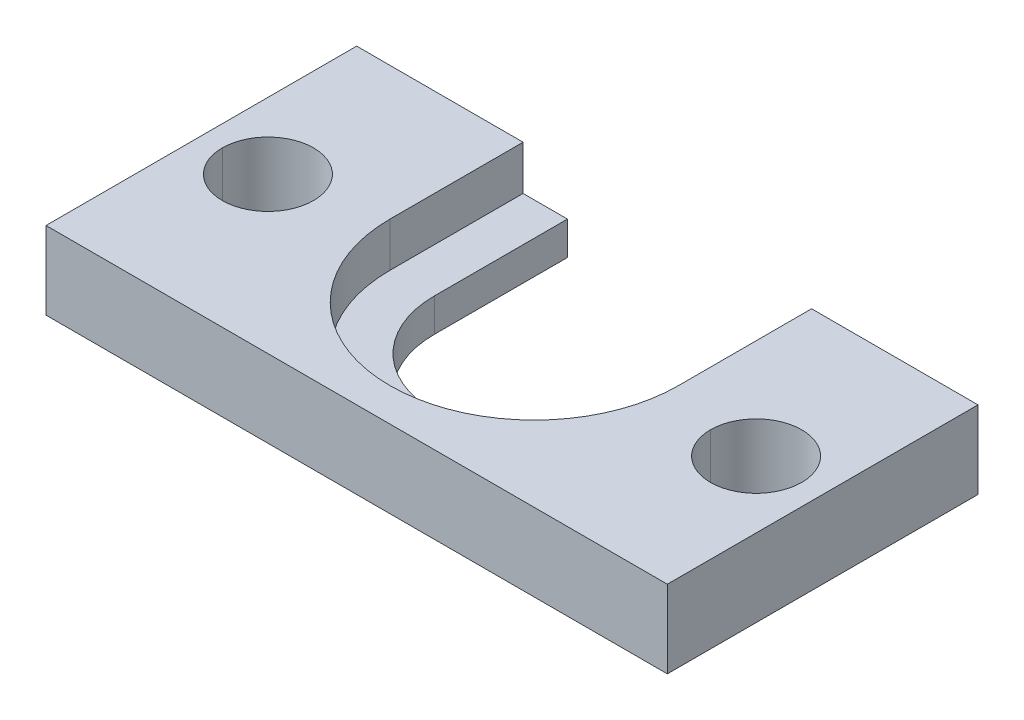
ISO-10303-21;
HEADER;
FILE_DESCRIPTION(('STEP AP214'),'2;1');
FILE_NAME('part.step','',(''),(''),'','','');
FILE_SCHEMA(('AUTOMOTIVE_DESIGN { 1 0 10303 214 1 1 1 1 }'));
ENDSEC;
DATA;
#1=APPLICATION_CONTEXT('core data for automotive mechanical design processes');
#2=APPLICATION_PROTOCOL_DEFINITION('international standard','automotive_design',2000,#1);
#3=PRODUCT_CONTEXT('',#1,'mechanical');
#4=PRODUCT('Part','Part','',(#3));
#5=PRODUCT_RELATED_PRODUCT_CATEGORY('part','',(#4));
#6=PRODUCT_DEFINITION_FORMATION('','',#4);
#7=PRODUCT_DEFINITION_CONTEXT('part definition',#1,'design');
#8=PRODUCT_DEFINITION('design','',#6,#7);
#9=PRODUCT_DEFINITION_SHAPE('','',#8);
#10=(LENGTH_UNIT() NAMED_UNIT(*) SI_UNIT(.MILLI.,.METRE.));
#11=(NAMED_UNIT(*) PLANE_ANGLE_UNIT() SI_UNIT($,.RADIAN.));
#12=(NAMED_UNIT(*) SI_UNIT($,.STERADIAN.) SOLID_ANGLE_UNIT());
#13=UNCERTAINTY_MEASURE_WITH_UNIT(LENGTH_MEASURE(1.E-05),#10,'distance_accuracy_value','');
#14=(GEOMETRIC_REPRESENTATION_CONTEXT(3) GLOBAL_UNCERTAINTY_ASSIGNED_CONTEXT((#13)) GLOBAL_UNIT_ASSIGNED_CONTEXT((#10,
#11,#12)) REPRESENTATION_CONTEXT('',''));
#15=CARTESIAN_POINT('',(0.,0.,0.));
#16=DIRECTION('',(0.,0.,1.));
#17=DIRECTION('',(1.,0.,0.));
#18=AXIS2_PLACEMENT_3D('',#15,#16,#17);
#19=CARTESIAN_POINT('',(0.,1.190625,-1.58750000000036));
#20=DIRECTION('',(0.,-1.,0.));
#21=DIRECTION('',(1.,0.,0.));
#22=AXIS2_PLACEMENT_3D('',#19,#20,#21);
#23=CYLINDRICAL_SURFACE('',#22,10.31875);
#24=CARTESIAN_POINT('',(0.,2.778125,-1.58750000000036));
#25=DIRECTION('',(0.,-1.,0.));
#26=DIRECTION('',(1.,0.,0.));
#27=AXIS2_PLACEMENT_3D('',#24,#25,#26);
#28=CIRCLE('',#27,10.31875);
#29=CARTESIAN_POINT('',(-10.31875,2.778125,-1.58750000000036));
#30=VERTEX_POINT('',#29);
#31=CARTESIAN_POINT('',(10.31875,2.778125,-1.58750000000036));
#32=VERTEX_POINT('',#31);
#33=EDGE_CURVE('E150',#30,#32,#28,.F.);
#34=ORIENTED_EDGE('',*,*,#33,.T.);
#35=DIRECTION('',(0.,1.,0.));
#36=VECTOR('',#35,1.);
#37=CARTESIAN_POINT('',(10.31875,-0.396875,-1.58750000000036));
#38=LINE('',#37,#36);
#39=CARTESIAN_POINT('',(10.31875,-0.396875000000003,-1.58750000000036));
#40=VERTEX_POINT('',#39);
#41=EDGE_CURVE('E127',#32,#40,#38,.F.);
#42=ORIENTED_EDGE('',*,*,#41,.T.);
#43=CARTESIAN_POINT('',(0.,-0.396875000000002,-1.58750000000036));
#44=DIRECTION('',(0.,-1.,0.));
#45=DIRECTION('',(1.,0.,0.));
#46=AXIS2_PLACEMENT_3D('',#43,#44,#45);
#47=CIRCLE('',#46,10.31875);
#48=CARTESIAN_POINT('',(-10.31875,-0.396874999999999,-1.58750000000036));
#49=VERTEX_POINT('',#48);
#50=EDGE_CURVE('E19',#40,#49,#47,.T.);
#51=ORIENTED_EDGE('',*,*,#50,.T.);
#52=DIRECTION('',(0.,-1.,0.));
#53=VECTOR('',#52,1.);
#54=CARTESIAN_POINT('',(-10.31875,2.778125,-1.58750000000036));
#55=LINE('',#54,#53);
#56=EDGE_CURVE('E131',#49,#30,#55,.F.);
#57=ORIENTED_EDGE('',*,*,#56,.T.);
#58=EDGE_LOOP('',(#34,#42,#51,#57));
#59=FACE_BOUND('',#58,.T.);
#60=ADVANCED_FACE('F16',(#59),#23,.F.);
#61=CARTESIAN_POINT('',(-10.31875,2.778125,-1.58750000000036));
#62=DIRECTION('',(-1.,0.,0.));
#63=DIRECTION('',(0.,-1.,0.));
#64=AXIS2_PLACEMENT_3D('',#61,#62,#63);
#65=PLANE('',#64);
#66=DIRECTION('',(0.,0.,1.));
#67=VECTOR('',#66,1.);
#68=CARTESIAN_POINT('',(-10.31875,2.778125,0.));
#69=LINE('',#68,#67);
#70=CARTESIAN_POINT('',(-10.31875,2.778125,-11.1125000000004));
#71=VERTEX_POINT('',#70);
#72=EDGE_CURVE('E142',#71,#30,#69,.T.);
#73=ORIENTED_EDGE('',*,*,#72,.T.);
#74=ORIENTED_EDGE('',*,*,#56,.F.);
#75=DIRECTION('',(0.,0.,1.));
#76=VECTOR('',#75,1.);
#77=CARTESIAN_POINT('',(-10.31875,-0.396874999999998,-1.58750000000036));
#78=LINE('',#77,#76);
#79=CARTESIAN_POINT('',(-10.31875,-0.396875,-11.1125000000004));
#80=VERTEX_POINT('',#79);
#81=EDGE_CURVE('E136',#49,#80,#78,.F.);
#82=ORIENTED_EDGE('',*,*,#81,.T.);
#83=DIRECTION('',(0.,-1.,0.));
#84=VECTOR('',#83,1.);
#85=CARTESIAN_POINT('',(-10.31875,0.,-11.1125000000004));
#86=LINE('',#85,#84);
#87=EDGE_CURVE('E181',#80,#71,#86,.F.);
#88=ORIENTED_EDGE('',*,*,#87,.T.);
#89=EDGE_LOOP('',(#73,#74,#82,#88));
#90=FACE_BOUND('',#89,.T.);
#91=ADVANCED_FACE('F139',(#90),#65,.F.);
#92=CARTESIAN_POINT('',(10.31875,-0.396875,-1.58750000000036));
#93=DIRECTION('',(1.,0.,0.));
#94=DIRECTION('',(0.,1.,0.));
#95=AXIS2_PLACEMENT_3D('',#92,#93,#94);
#96=PLANE('',#95);
#97=DIRECTION('',(0.,0.,1.));
#98=VECTOR('',#97,1.);
#99=CARTESIAN_POINT('',(10.31875,-0.396875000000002,-1.58750000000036));
#100=LINE('',#99,#98);
#101=CARTESIAN_POINT('',(10.31875,-0.396875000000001,-11.1125000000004));
#102=VERTEX_POINT('',#101);
#103=EDGE_CURVE('E137',#102,#40,#100,.T.);
#104=ORIENTED_EDGE('',*,*,#103,.T.);
#105=ORIENTED_EDGE('',*,*,#41,.F.);
#106=DIRECTION('',(0.,0.,1.));
#107=VECTOR('',#106,1.);
#108=CARTESIAN_POINT('',(10.31875,2.77812499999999,0.));
#109=LINE('',#108,#107);
#110=CARTESIAN_POINT('',(10.31875,2.77812499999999,-11.1125000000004));
#111=VERTEX_POINT('',#110);
#112=EDGE_CURVE('E237',#32,#111,#109,.F.);
#113=ORIENTED_EDGE('',*,*,#112,.T.);
#114=DIRECTION('',(0.,1.,0.));
#115=VECTOR('',#114,1.);
#116=CARTESIAN_POINT('',(10.31875,2.778125,-11.1125000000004));
#117=LINE('',#116,#115);
#118=EDGE_CURVE('E200',#102,#111,#117,.T.);
#119=ORIENTED_EDGE('',*,*,#118,.F.);
#120=EDGE_LOOP('',(#104,#105,#113,#119));
#121=FACE_BOUND('',#120,.T.);
#122=ADVANCED_FACE('F291',(#121),#96,.F.);
#123=CARTESIAN_POINT('',(0.,-0.396875,-1.58750000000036));
#124=DIRECTION('',(0.,-1.,0.));
#125=DIRECTION('',(1.,0.,0.));
#126=AXIS2_PLACEMENT_3D('',#123,#124,#125);
#127=PLANE('',#126);
#128=ORIENTED_EDGE('',*,*,#81,.F.);
#129=ORIENTED_EDGE('',*,*,#50,.F.);
#130=ORIENTED_EDGE('',*,*,#103,.F.);
#131=DIRECTION('',(-1.,0.,0.));
#132=VECTOR('',#131,1.);
#133=CARTESIAN_POINT('',(0.,-0.396875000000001,-11.1125000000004));
#134=LINE('',#133,#132);
#135=CARTESIAN_POINT('',(7.14375,-0.396875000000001,-11.1125000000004));
#136=VERTEX_POINT('',#135);
#137=EDGE_CURVE('E167',#136,#102,#134,.F.);
#138=ORIENTED_EDGE('',*,*,#137,.F.);
#139=DIRECTION('',(0.,0.,1.));
#140=VECTOR('',#139,1.);
#141=CARTESIAN_POINT('',(7.14375,-0.396875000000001,-1.58750000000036));
#142=LINE('',#141,#140);
#143=CARTESIAN_POINT('',(7.14375,-0.396875,-1.58750000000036));
#144=VERTEX_POINT('',#143);
#145=EDGE_CURVE('E161',#136,#144,#142,.T.);
#146=ORIENTED_EDGE('',*,*,#145,.T.);
#147=CARTESIAN_POINT('',(0.,-0.396874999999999,-1.58750000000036));
#148=DIRECTION('',(0.,-1.,0.));
#149=DIRECTION('',(1.,0.,0.));
#150=AXIS2_PLACEMENT_3D('',#147,#148,#149);
#151=CIRCLE('',#150,7.14375);
#152=CARTESIAN_POINT('',(-7.14375,-0.396874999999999,-1.58750000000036));
#153=VERTEX_POINT('',#152);
#154=EDGE_CURVE('E225',#144,#153,#151,.T.);
#155=ORIENTED_EDGE('',*,*,#154,.T.);
#156=DIRECTION('',(0.,0.,1.));
#157=VECTOR('',#156,1.);
#158=CARTESIAN_POINT('',(-7.14375,-0.396875,-1.58750000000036));
#159=LINE('',#158,#157);
#160=CARTESIAN_POINT('',(-7.14375,-0.396875,-11.1125000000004));
#161=VERTEX_POINT('',#160);
#162=EDGE_CURVE('E174',#153,#161,#159,.F.);
#163=ORIENTED_EDGE('',*,*,#162,.T.);
#164=DIRECTION('',(1.,0.,0.));
#165=VECTOR('',#164,1.);
#166=CARTESIAN_POINT('',(-20.6375,-0.396875,-11.1125000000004));
#167=LINE('',#166,#165);
#168=EDGE_CURVE('E147',#161,#80,#167,.F.);
#169=ORIENTED_EDGE('',*,*,#168,.T.);
#170=EDGE_LOOP('',(#128,#129,#130,#138,#146,#155,#163,#169));
#171=FACE_BOUND('',#170,.T.);
#172=ADVANCED_FACE('F145',(#171),#127,.F.);
#173=CARTESIAN_POINT('',(-20.6375,2.778125,0.));
#174=DIRECTION('',(0.,-1.,0.));
#175=DIRECTION('',(1.,0.,0.));
#176=AXIS2_PLACEMENT_3D('',#173,#174,#175);
#177=PLANE('',#176);
#178=DIRECTION('',(0.,0.,1.));
#179=VECTOR('',#178,1.);
#180=CARTESIAN_POINT('',(-22.225,2.778125,0.));
#181=LINE('',#180,#179);
#182=CARTESIAN_POINT('',(-22.225,2.778125,-11.1125000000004));
#183=VERTEX_POINT('',#182);
#184=CARTESIAN_POINT('',(-22.225,2.778125,11.1125000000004));
#185=VERTEX_POINT('',#184);
#186=EDGE_CURVE('E185',#183,#185,#181,.T.);
#187=ORIENTED_EDGE('',*,*,#186,.T.);
#188=DIRECTION('',(-1.,0.,0.));
#189=VECTOR('',#188,1.);
#190=CARTESIAN_POINT('',(-20.6375,2.778125,11.1125000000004));
#191=LINE('',#190,#189);
#192=CARTESIAN_POINT('',(22.225,2.778125,11.1125000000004));
#193=VERTEX_POINT('',#192);
#194=EDGE_CURVE('E187',#185,#193,#191,.F.);
#195=ORIENTED_EDGE('',*,*,#194,.T.);
#196=DIRECTION('',(0.,0.,1.));
#197=VECTOR('',#196,1.);
#198=CARTESIAN_POINT('',(22.225,2.778125,0.));
#199=LINE('',#198,#197);
#200=CARTESIAN_POINT('',(22.225,2.778125,-11.1125000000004));
#201=VERTEX_POINT('',#200);
#202=EDGE_CURVE('E252',#193,#201,#199,.F.);
#203=ORIENTED_EDGE('',*,*,#202,.T.);
#204=DIRECTION('',(-1.,0.,0.));
#205=VECTOR('',#204,1.);
#206=CARTESIAN_POINT('',(0.,2.778125,-11.1125000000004));
#207=LINE('',#206,#205);
#208=EDGE_CURVE('E198',#111,#201,#207,.F.);
#209=ORIENTED_EDGE('',*,*,#208,.F.);
#210=ORIENTED_EDGE('',*,*,#112,.F.);
#211=ORIENTED_EDGE('',*,*,#33,.F.);
#212=ORIENTED_EDGE('',*,*,#72,.F.);
#213=DIRECTION('',(1.,0.,0.));
#214=VECTOR('',#213,1.);
#215=CARTESIAN_POINT('',(-20.6375,2.778125,-11.1125000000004));
#216=LINE('',#215,#214);
#217=EDGE_CURVE('E190',#71,#183,#216,.F.);
#218=ORIENTED_EDGE('',*,*,#217,.T.);
#219=EDGE_LOOP('',(#187,#195,#203,#209,#210,#211,#212,#218));
#220=FACE_BOUND('',#219,.T.);
#221=CARTESIAN_POINT('',(17.4625,2.778125,0.));
#222=DIRECTION('',(0.,-1.,0.));
#223=DIRECTION('',(1.,0.,0.));
#224=AXIS2_PLACEMENT_3D('',#221,#222,#223);
#225=CIRCLE('',#224,3.2639);
#226=CARTESIAN_POINT('',(14.1986,2.778125,0.));
#227=VERTEX_POINT('',#226);
#228=CARTESIAN_POINT('',(20.7264,2.778125,0.));
#229=VERTEX_POINT('',#228);
#230=EDGE_CURVE('E227',#227,#229,#225,.T.);
#231=ORIENTED_EDGE('',*,*,#230,.T.);
#232=CARTESIAN_POINT('',(17.4625,2.778125,0.));
#233=DIRECTION('',(0.,-1.,0.));
#234=DIRECTION('',(1.,0.,0.));
#235=AXIS2_PLACEMENT_3D('',#232,#233,#234);
#236=CIRCLE('',#235,3.2639);
#237=EDGE_CURVE('E230',#229,#227,#236,.T.);
#238=ORIENTED_EDGE('',*,*,#237,.T.);
#239=EDGE_LOOP('',(#231,#238));
#240=FACE_BOUND('',#239,.T.);
#241=CARTESIAN_POINT('',(-17.4625,2.778125,0.));
#242=DIRECTION('',(0.,1.,0.));
#243=DIRECTION('',(-1.,0.,0.));
#244=AXIS2_PLACEMENT_3D('',#241,#242,#243);
#245=CIRCLE('',#244,3.2639);
#246=CARTESIAN_POINT('',(-14.1986,2.778125,0.));
#247=VERTEX_POINT('',#246);
#248=CARTESIAN_POINT('',(-20.7264,2.778125,0.));
#249=VERTEX_POINT('',#248);
#250=EDGE_CURVE('E233',#247,#249,#245,.F.);
#251=ORIENTED_EDGE('',*,*,#250,.T.);
#252=CARTESIAN_POINT('',(-17.4625,2.778125,0.));
#253=DIRECTION('',(0.,1.,0.));
#254=DIRECTION('',(-1.,0.,0.));
#255=AXIS2_PLACEMENT_3D('',#252,#253,#254);
#256=CIRCLE('',#255,3.2639);
#257=EDGE_CURVE('E236',#249,#247,#256,.F.);
#258=ORIENTED_EDGE('',*,*,#257,.T.);
#259=EDGE_LOOP('',(#251,#258));
#260=FACE_BOUND('',#259,.T.);
#261=ADVANCED_FACE('F282',(#220,#240,#260),#177,.F.);
#262=CARTESIAN_POINT('',(-17.4625,3.571875,0.));
#263=DIRECTION('',(0.,1.,0.));
#264=DIRECTION('',(-1.,0.,0.));
#265=AXIS2_PLACEMENT_3D('',#262,#263,#264);
#266=CYLINDRICAL_SURFACE('',#265,3.2639);
#267=ORIENTED_EDGE('',*,*,#257,.F.);
#268=DIRECTION('',(0.,1.,0.));
#269=VECTOR('',#268,1.);
#270=CARTESIAN_POINT('',(-20.7264,3.571875,0.));
#271=LINE('',#270,#269);
#272=CARTESIAN_POINT('',(-20.7264,-2.778125,0.));
#273=VERTEX_POINT('',#272);
#274=EDGE_CURVE('E235',#249,#273,#271,.F.);
#275=ORIENTED_EDGE('',*,*,#274,.T.);
#276=CARTESIAN_POINT('',(-17.4625,-2.778125,0.));
#277=DIRECTION('',(0.,1.,0.));
#278=DIRECTION('',(-1.,0.,0.));
#279=AXIS2_PLACEMENT_3D('',#276,#277,#278);
#280=CIRCLE('',#279,3.2639);
#281=CARTESIAN_POINT('',(-14.1986,-2.778125,0.));
#282=VERTEX_POINT('',#281);
#283=EDGE_CURVE('E222',#282,#273,#280,.T.);
#284=ORIENTED_EDGE('',*,*,#283,.F.);
#285=DIRECTION('',(0.,1.,0.));
#286=VECTOR('',#285,1.);
#287=CARTESIAN_POINT('',(-14.1986,3.571875,0.));
#288=LINE('',#287,#286);
#289=EDGE_CURVE('E232',#282,#247,#288,.T.);
#290=ORIENTED_EDGE('',*,*,#289,.T.);
#291=EDGE_LOOP('',(#267,#275,#284,#290));
#292=FACE_BOUND('',#291,.T.);
#293=ADVANCED_FACE('F278',(#292),#266,.F.);
#294=CARTESIAN_POINT('',(-17.4625,3.571875,0.));
#295=DIRECTION('',(0.,1.,0.));
#296=DIRECTION('',(-1.,0.,0.));
#297=AXIS2_PLACEMENT_3D('',#294,#295,#296);
#298=CYLINDRICAL_SURFACE('',#297,3.2639);
#299=CARTESIAN_POINT('',(-17.4625,-2.778125,0.));
#300=DIRECTION('',(0.,1.,0.));
#301=DIRECTION('',(-1.,0.,0.));
#302=AXIS2_PLACEMENT_3D('',#299,#300,#301);
#303=CIRCLE('',#302,3.2639);
#304=EDGE_CURVE('E219',#273,#282,#303,.T.);
#305=ORIENTED_EDGE('',*,*,#304,.F.);
#306=ORIENTED_EDGE('',*,*,#274,.F.);
#307=ORIENTED_EDGE('',*,*,#250,.F.);
#308=ORIENTED_EDGE('',*,*,#289,.F.);
#309=EDGE_LOOP('',(#305,#306,#307,#308));
#310=FACE_BOUND('',#309,.T.);
#311=ADVANCED_FACE('F280',(#310),#298,.F.);
#312=CARTESIAN_POINT('',(17.4625,3.571875,0.));
#313=DIRECTION('',(0.,-1.,0.));
#314=DIRECTION('',(1.,0.,0.));
#315=AXIS2_PLACEMENT_3D('',#312,#313,#314);
#316=CYLINDRICAL_SURFACE('',#315,3.2639);
#317=ORIENTED_EDGE('',*,*,#237,.F.);
#318=DIRECTION('',(0.,-1.,0.));
#319=VECTOR('',#318,1.);
#320=CARTESIAN_POINT('',(20.7264,3.571875,0.));
#321=LINE('',#320,#319);
#322=CARTESIAN_POINT('',(20.7264,-2.778125,0.));
#323=VERTEX_POINT('',#322);
#324=EDGE_CURVE('E229',#229,#323,#321,.T.);
#325=ORIENTED_EDGE('',*,*,#324,.T.);
#326=CARTESIAN_POINT('',(17.4625,-2.778125,0.));
#327=DIRECTION('',(0.,-1.,0.));
#328=DIRECTION('',(1.,0.,0.));
#329=AXIS2_PLACEMENT_3D('',#326,#327,#328);
#330=CIRCLE('',#329,3.2639);
#331=CARTESIAN_POINT('',(14.1986,-2.778125,0.));
#332=VERTEX_POINT('',#331);
#333=EDGE_CURVE('E216',#332,#323,#330,.F.);
#334=ORIENTED_EDGE('',*,*,#333,.F.);
#335=DIRECTION('',(0.,-1.,0.));
#336=VECTOR('',#335,1.);
#337=CARTESIAN_POINT('',(14.1986,3.571875,0.));
#338=LINE('',#337,#336);
#339=EDGE_CURVE('E250',#332,#227,#338,.F.);
#340=ORIENTED_EDGE('',*,*,#339,.T.);
#341=EDGE_LOOP('',(#317,#325,#334,#340));
#342=FACE_BOUND('',#341,.T.);
#343=ADVANCED_FACE('F336',(#342),#316,.F.);
#344=CARTESIAN_POINT('',(17.4625,3.571875,0.));
#345=DIRECTION('',(0.,-1.,0.));
#346=DIRECTION('',(1.,0.,0.));
#347=AXIS2_PLACEMENT_3D('',#344,#345,#346);
#348=CYLINDRICAL_SURFACE('',#347,3.2639);
#349=CARTESIAN_POINT('',(17.4625,-2.778125,0.));
#350=DIRECTION('',(0.,-1.,0.));
#351=DIRECTION('',(1.,0.,0.));
#352=AXIS2_PLACEMENT_3D('',#349,#350,#351);
#353=CIRCLE('',#352,3.2639);
#354=EDGE_CURVE('E212',#323,#332,#353,.F.);
#355=ORIENTED_EDGE('',*,*,#354,.F.);
#356=ORIENTED_EDGE('',*,*,#324,.F.);
#357=ORIENTED_EDGE('',*,*,#230,.F.);
#358=ORIENTED_EDGE('',*,*,#339,.F.);
#359=EDGE_LOOP('',(#355,#356,#357,#358));
#360=FACE_BOUND('',#359,.T.);
#361=ADVANCED_FACE('F333',(#360),#348,.F.);
#362=CARTESIAN_POINT('',(-20.6375,0.,11.1125000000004));
#363=DIRECTION('',(0.,0.,-1.));
#364=DIRECTION('',(-1.,0.,0.));
#365=AXIS2_PLACEMENT_3D('',#362,#363,#364);
#366=PLANE('',#365);
#367=DIRECTION('',(1.,0.,0.));
#368=VECTOR('',#367,1.);
#369=CARTESIAN_POINT('',(-20.6375,-2.778125,11.1125000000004));
#370=LINE('',#369,#368);
#371=CARTESIAN_POINT('',(22.225,-2.77812500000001,11.1125000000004));
#372=VERTEX_POINT('',#371);
#373=CARTESIAN_POINT('',(-22.225,-2.778125,11.1125000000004));
#374=VERTEX_POINT('',#373);
#375=EDGE_CURVE('E215',#372,#374,#370,.F.);
#376=ORIENTED_EDGE('',*,*,#375,.F.);
#377=DIRECTION('',(0.,-1.,0.));
#378=VECTOR('',#377,1.);
#379=CARTESIAN_POINT('',(22.225,0.,11.1125000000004));
#380=LINE('',#379,#378);
#381=EDGE_CURVE('E170',#372,#193,#380,.F.);
#382=ORIENTED_EDGE('',*,*,#381,.T.);
#383=ORIENTED_EDGE('',*,*,#194,.F.);
#384=DIRECTION('',(0.,1.,0.));
#385=VECTOR('',#384,1.);
#386=CARTESIAN_POINT('',(-22.225,0.,11.1125000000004));
#387=LINE('',#386,#385);
#388=EDGE_CURVE('E182',#185,#374,#387,.F.);
#389=ORIENTED_EDGE('',*,*,#388,.T.);
#390=EDGE_LOOP('',(#376,#382,#383,#389));
#391=FACE_BOUND('',#390,.T.);
#392=ADVANCED_FACE('F329',(#391),#366,.F.);
#393=CARTESIAN_POINT('',(-22.225,0.,0.));
#394=DIRECTION('',(1.,0.,0.));
#395=DIRECTION('',(0.,1.,0.));
#396=AXIS2_PLACEMENT_3D('',#393,#394,#395);
#397=PLANE('',#396);
#398=DIRECTION('',(0.,0.,1.));
#399=VECTOR('',#398,1.);
#400=CARTESIAN_POINT('',(-22.225,-2.778125,0.));
#401=LINE('',#400,#399);
#402=CARTESIAN_POINT('',(-22.225,-2.778125,-11.1125000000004));
#403=VERTEX_POINT('',#402);
#404=EDGE_CURVE('E437',#374,#403,#401,.F.);
#405=ORIENTED_EDGE('',*,*,#404,.F.);
#406=ORIENTED_EDGE('',*,*,#388,.F.);
#407=ORIENTED_EDGE('',*,*,#186,.F.);
#408=DIRECTION('',(0.,-1.,0.));
#409=VECTOR('',#408,1.);
#410=CARTESIAN_POINT('',(-22.225,0.,-11.1125000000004));
#411=LINE('',#410,#409);
#412=EDGE_CURVE('E177',#183,#403,#411,.T.);
#413=ORIENTED_EDGE('',*,*,#412,.T.);
#414=EDGE_LOOP('',(#405,#406,#407,#413));
#415=FACE_BOUND('',#414,.T.);
#416=ADVANCED_FACE('F325',(#415),#397,.F.);
#417=CARTESIAN_POINT('',(-20.6375,0.,-11.1125000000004));
#418=DIRECTION('',(0.,0.,1.));
#419=DIRECTION('',(0.,-1.,0.));
#420=AXIS2_PLACEMENT_3D('',#417,#418,#419);
#421=PLANE('',#420);
#422=ORIENTED_EDGE('',*,*,#412,.F.);
#423=ORIENTED_EDGE('',*,*,#217,.F.);
#424=ORIENTED_EDGE('',*,*,#87,.F.);
#425=ORIENTED_EDGE('',*,*,#168,.F.);
#426=DIRECTION('',(0.,-1.,0.));
#427=VECTOR('',#426,1.);
#428=CARTESIAN_POINT('',(-7.14375,-0.396875,-11.1125000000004));
#429=LINE('',#428,#427);
#430=CARTESIAN_POINT('',(-7.14375,-2.778125,-11.1125000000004));
#431=VERTEX_POINT('',#430);
#432=EDGE_CURVE('E176',#161,#431,#429,.T.);
#433=ORIENTED_EDGE('',*,*,#432,.T.);
#434=DIRECTION('',(1.,0.,0.));
#435=VECTOR('',#434,1.);
#436=CARTESIAN_POINT('',(-20.6375,-2.778125,-11.1125000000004));
#437=LINE('',#436,#435);
#438=EDGE_CURVE('E434',#403,#431,#437,.T.);
#439=ORIENTED_EDGE('',*,*,#438,.F.);
#440=EDGE_LOOP('',(#422,#423,#424,#425,#433,#439));
#441=FACE_BOUND('',#440,.T.);
#442=ADVANCED_FACE('F321',(#441),#421,.F.);
#443=CARTESIAN_POINT('',(-7.14375,-0.396875,-1.58750000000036));
#444=DIRECTION('',(-1.,0.,0.));
#445=DIRECTION('',(0.,-1.,0.));
#446=AXIS2_PLACEMENT_3D('',#443,#444,#445);
#447=PLANE('',#446);
#448=ORIENTED_EDGE('',*,*,#162,.F.);
#449=DIRECTION('',(0.,-1.,0.));
#450=VECTOR('',#449,1.);
#451=CARTESIAN_POINT('',(-7.14375,-1.5875,-1.58750000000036));
#452=LINE('',#451,#450);
#453=CARTESIAN_POINT('',(-7.14375,-2.778125,-1.58750000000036));
#454=VERTEX_POINT('',#453);
#455=EDGE_CURVE('E164',#153,#454,#452,.T.);
#456=ORIENTED_EDGE('',*,*,#455,.T.);
#457=DIRECTION('',(0.,0.,1.));
#458=VECTOR('',#457,1.);
#459=CARTESIAN_POINT('',(-7.14375,-2.778125,0.));
#460=LINE('',#459,#458);
#461=EDGE_CURVE('E211',#431,#454,#460,.T.);
#462=ORIENTED_EDGE('',*,*,#461,.F.);
#463=ORIENTED_EDGE('',*,*,#432,.F.);
#464=EDGE_LOOP('',(#448,#456,#462,#463));
#465=FACE_BOUND('',#464,.T.);
#466=ADVANCED_FACE('F317',(#465),#447,.F.);
#467=CARTESIAN_POINT('',(0.,-1.5875,-1.58750000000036));
#468=DIRECTION('',(0.,-1.,0.));
#469=DIRECTION('',(1.,0.,0.));
#470=AXIS2_PLACEMENT_3D('',#467,#468,#469);
#471=CYLINDRICAL_SURFACE('',#470,7.14375);
#472=CARTESIAN_POINT('',(0.,-2.778125,-1.58750000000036));
#473=DIRECTION('',(0.,-1.,0.));
#474=DIRECTION('',(1.,0.,0.));
#475=AXIS2_PLACEMENT_3D('',#472,#473,#474);
#476=CIRCLE('',#475,7.14375);
#477=CARTESIAN_POINT('',(7.14375,-2.778125,-1.58750000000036));
#478=VERTEX_POINT('',#477);
#479=EDGE_CURVE('E207',#454,#478,#476,.F.);
#480=ORIENTED_EDGE('',*,*,#479,.F.);
#481=ORIENTED_EDGE('',*,*,#455,.F.);
#482=ORIENTED_EDGE('',*,*,#154,.F.);
#483=DIRECTION('',(0.,1.,0.));
#484=VECTOR('',#483,1.);
#485=CARTESIAN_POINT('',(7.14375,-2.778125,-1.58750000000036));
#486=LINE('',#485,#484);
#487=EDGE_CURVE('E163',#144,#478,#486,.F.);
#488=ORIENTED_EDGE('',*,*,#487,.T.);
#489=EDGE_LOOP('',(#480,#481,#482,#488));
#490=FACE_BOUND('',#489,.T.);
#491=ADVANCED_FACE('F313',(#490),#471,.F.);
#492=CARTESIAN_POINT('',(7.14375,-2.778125,-1.58750000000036));
#493=DIRECTION('',(1.,0.,0.));
#494=DIRECTION('',(0.,1.,0.));
#495=AXIS2_PLACEMENT_3D('',#492,#493,#494);
#496=PLANE('',#495);
#497=DIRECTION('',(0.,0.,1.));
#498=VECTOR('',#497,1.);
#499=CARTESIAN_POINT('',(7.14375,-2.77812500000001,0.));
#500=LINE('',#499,#498);
#501=CARTESIAN_POINT('',(7.14375,-2.77812500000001,-11.1125000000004));
#502=VERTEX_POINT('',#501);
#503=EDGE_CURVE('E210',#478,#502,#500,.F.);
#504=ORIENTED_EDGE('',*,*,#503,.F.);
#505=ORIENTED_EDGE('',*,*,#487,.F.);
#506=ORIENTED_EDGE('',*,*,#145,.F.);
#507=DIRECTION('',(0.,1.,0.));
#508=VECTOR('',#507,1.);
#509=CARTESIAN_POINT('',(7.14375,2.778125,-11.1125000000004));
#510=LINE('',#509,#508);
#511=EDGE_CURVE('E171',#502,#136,#510,.T.);
#512=ORIENTED_EDGE('',*,*,#511,.F.);
#513=EDGE_LOOP('',(#504,#505,#506,#512));
#514=FACE_BOUND('',#513,.T.);
#515=ADVANCED_FACE('F310',(#514),#496,.F.);
#516=CARTESIAN_POINT('',(0.,2.778125,-11.1125000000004));
#517=DIRECTION('',(0.,0.,-1.));
#518=DIRECTION('',(-1.,0.,0.));
#519=AXIS2_PLACEMENT_3D('',#516,#517,#518);
#520=PLANE('',#519);
#521=ORIENTED_EDGE('',*,*,#511,.T.);
#522=ORIENTED_EDGE('',*,*,#137,.T.);
#523=ORIENTED_EDGE('',*,*,#118,.T.);
#524=ORIENTED_EDGE('',*,*,#208,.T.);
#525=DIRECTION('',(0.,-1.,0.));
#526=VECTOR('',#525,1.);
#527=CARTESIAN_POINT('',(22.225,0.,-11.1125000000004));
#528=LINE('',#527,#526);
#529=CARTESIAN_POINT('',(22.225,-2.778125,-11.1125000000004));
#530=VERTEX_POINT('',#529);
#531=EDGE_CURVE('E34',#201,#530,#528,.T.);
#532=ORIENTED_EDGE('',*,*,#531,.T.);
#533=DIRECTION('',(1.,0.,0.));
#534=VECTOR('',#533,1.);
#535=CARTESIAN_POINT('',(-20.6375,-2.778125,-11.1125000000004));
#536=LINE('',#535,#534);
#537=EDGE_CURVE('E25',#502,#530,#536,.T.);
#538=ORIENTED_EDGE('',*,*,#537,.F.);
#539=EDGE_LOOP('',(#521,#522,#523,#524,#532,#538));
#540=FACE_BOUND('',#539,.T.);
#541=ADVANCED_FACE('F302',(#540),#520,.T.);
#542=CARTESIAN_POINT('',(22.225,0.,0.));
#543=DIRECTION('',(-1.,0.,0.));
#544=DIRECTION('',(0.,-1.,0.));
#545=AXIS2_PLACEMENT_3D('',#542,#543,#544);
#546=PLANE('',#545);
#547=ORIENTED_EDGE('',*,*,#202,.F.);
#548=ORIENTED_EDGE('',*,*,#381,.F.);
#549=DIRECTION('',(0.,0.,1.));
#550=VECTOR('',#549,1.);
#551=CARTESIAN_POINT('',(22.225,-2.77812500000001,0.));
#552=LINE('',#551,#550);
#553=EDGE_CURVE('E11',#530,#372,#552,.T.);
#554=ORIENTED_EDGE('',*,*,#553,.F.);
#555=ORIENTED_EDGE('',*,*,#531,.F.);
#556=EDGE_LOOP('',(#547,#548,#554,#555));
#557=FACE_BOUND('',#556,.T.);
#558=ADVANCED_FACE('F296',(#557),#546,.F.);
#559=CARTESIAN_POINT('',(-20.6375,-2.778125,0.));
#560=DIRECTION('',(0.,-1.,0.));
#561=DIRECTION('',(1.,0.,0.));
#562=AXIS2_PLACEMENT_3D('',#559,#560,#561);
#563=PLANE('',#562);
#564=ORIENTED_EDGE('',*,*,#537,.T.);
#565=ORIENTED_EDGE('',*,*,#553,.T.);
#566=ORIENTED_EDGE('',*,*,#375,.T.);
#567=ORIENTED_EDGE('',*,*,#404,.T.);
#568=ORIENTED_EDGE('',*,*,#438,.T.);
#569=ORIENTED_EDGE('',*,*,#461,.T.);
#570=ORIENTED_EDGE('',*,*,#479,.T.);
#571=ORIENTED_EDGE('',*,*,#503,.T.);
#572=EDGE_LOOP('',(#564,#565,#566,#567,#568,#569,#570,#571));
#573=FACE_BOUND('',#572,.T.);
#574=ORIENTED_EDGE('',*,*,#333,.T.);
#575=ORIENTED_EDGE('',*,*,#354,.T.);
#576=EDGE_LOOP('',(#574,#575));
#577=FACE_BOUND('',#576,.T.);
#578=ORIENTED_EDGE('',*,*,#283,.T.);
#579=ORIENTED_EDGE('',*,*,#304,.T.);
#580=EDGE_LOOP('',(#578,#579));
#581=FACE_BOUND('',#580,.T.);
#582=ADVANCED_FACE('F294',(#573,#577,#581),#563,.T.);
#583=CLOSED_SHELL('',(#60,#91,#122,#172,#261,#293,#311,#343,#361,#392,#416,#442,#466,#491,#515,
#541,#558,#582));
#584=MANIFOLD_SOLID_BREP('B1',#583);
#585=ADVANCED_BREP_SHAPE_REPRESENTATION('',(#18,#584),#14);
#586=SHAPE_DEFINITION_REPRESENTATION(#9,#585);
ENDSEC;
END-ISO-10303-21;
